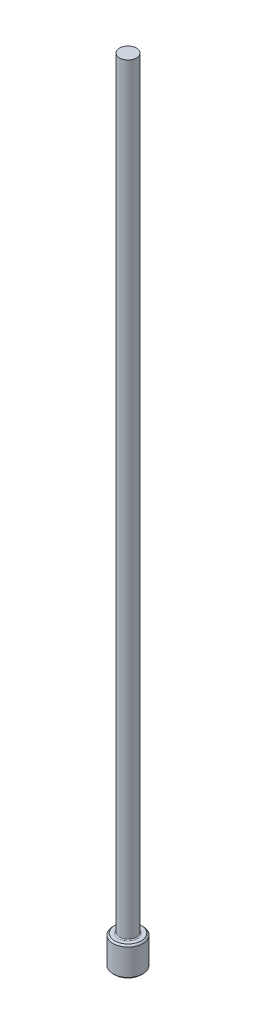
from build123d import *

# Parameters (mm, degrees)
CHAMFER1_SIZE = 0.127
FILLET1_R     = 0.0762


with BuildPart() as part:
    # Sketch1 → Revolve1 (revolve)
    with BuildSketch(Plane.XY, mode=Mode.PRIVATE) as revolve1_sk:
        Polygon((0, 0), (-1.1938, 0), (-1.1938, 2.3622), (-0.6858, 2.3622), (-0.6858, 63.5), (0, 63.5), align=None)
    revolve(revolve1_sk.sketch.rotate(Axis((0, 259.958771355, 0), (0, -1, 0)), 270), axis=Axis((0, 259.958771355, 0), (0, -1, 0)))

    # Chamfer1
    chamfer1_edges = [part.edges().sort_by_distance(p)[0] for p in [
        (0, 2.3622, -1.1938),
        (0, 0, -1.1938),
    ]]
    chamfer(chamfer1_edges, length=CHAMFER1_SIZE)

    # Fillet1
    fillet1_edges = [part.edges().sort_by_distance(p)[0] for p in [
        (0, 2.3622, -0.6858),
    ]]
    fillet(fillet1_edges, radius=FILLET1_R)


solid = part.part
